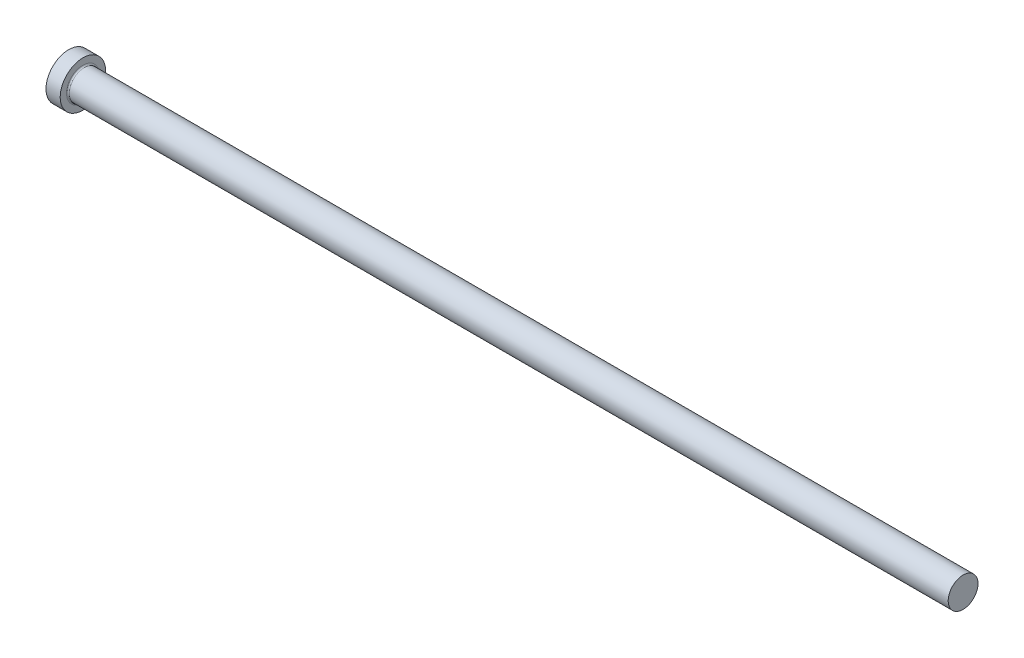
ISO-10303-21;
HEADER;
FILE_DESCRIPTION(('STEP AP214'),'2;1');
FILE_NAME('part.step','',(''),(''),'','','');
FILE_SCHEMA(('AUTOMOTIVE_DESIGN { 1 0 10303 214 1 1 1 1 }'));
ENDSEC;
DATA;
#1=APPLICATION_CONTEXT('core data for automotive mechanical design processes');
#2=APPLICATION_PROTOCOL_DEFINITION('international standard','automotive_design',2000,#1);
#3=PRODUCT_CONTEXT('',#1,'mechanical');
#4=PRODUCT('Part','Part','',(#3));
#5=PRODUCT_RELATED_PRODUCT_CATEGORY('part','',(#4));
#6=PRODUCT_DEFINITION_FORMATION('','',#4);
#7=PRODUCT_DEFINITION_CONTEXT('part definition',#1,'design');
#8=PRODUCT_DEFINITION('design','',#6,#7);
#9=PRODUCT_DEFINITION_SHAPE('','',#8);
#10=(LENGTH_UNIT() NAMED_UNIT(*) SI_UNIT(.MILLI.,.METRE.));
#11=(NAMED_UNIT(*) PLANE_ANGLE_UNIT() SI_UNIT($,.RADIAN.));
#12=(NAMED_UNIT(*) SI_UNIT($,.STERADIAN.) SOLID_ANGLE_UNIT());
#13=UNCERTAINTY_MEASURE_WITH_UNIT(LENGTH_MEASURE(1.E-05),#10,'distance_accuracy_value','');
#14=(GEOMETRIC_REPRESENTATION_CONTEXT(3) GLOBAL_UNCERTAINTY_ASSIGNED_CONTEXT((#13)) GLOBAL_UNIT_ASSIGNED_CONTEXT((#10,
#11,#12)) REPRESENTATION_CONTEXT('',''));
#15=CARTESIAN_POINT('',(0.,0.,0.));
#16=DIRECTION('',(0.,0.,1.));
#17=DIRECTION('',(1.,0.,0.));
#18=AXIS2_PLACEMENT_3D('',#15,#16,#17);
#19=CARTESIAN_POINT('',(0.,0.,0.));
#20=DIRECTION('',(-1.,0.,0.));
#21=DIRECTION('',(0.,-1.,0.));
#22=AXIS2_PLACEMENT_3D('',#19,#20,#21);
#23=PLANE('',#22);
#24=CARTESIAN_POINT('',(0.,0.,0.));
#25=DIRECTION('',(1.,0.,0.));
#26=DIRECTION('',(0.,1.,0.));
#27=AXIS2_PLACEMENT_3D('',#24,#25,#26);
#28=CIRCLE('',#27,8.);
#29=CARTESIAN_POINT('',(0.,8.,0.));
#30=VERTEX_POINT('',#29);
#31=EDGE_CURVE('E25',#30,#30,#28,.T.);
#32=ORIENTED_EDGE('',*,*,#31,.F.);
#33=EDGE_LOOP('',(#32));
#34=FACE_BOUND('',#33,.T.);
#35=ADVANCED_FACE('F14',(#34),#23,.T.);
#36=CARTESIAN_POINT('',(315.,0.,0.));
#37=DIRECTION('',(1.,0.,0.));
#38=DIRECTION('',(0.,1.,0.));
#39=AXIS2_PLACEMENT_3D('',#36,#37,#38);
#40=CYLINDRICAL_SURFACE('',#39,8.);
#41=ORIENTED_EDGE('',*,*,#31,.T.);
#42=EDGE_LOOP('',(#41));
#43=FACE_BOUND('',#42,.T.);
#44=CARTESIAN_POINT('',(5.,0.,0.));
#45=DIRECTION('',(1.,0.,0.));
#46=DIRECTION('',(0.,1.,0.));
#47=AXIS2_PLACEMENT_3D('',#44,#45,#46);
#48=CIRCLE('',#47,8.);
#49=CARTESIAN_POINT('',(5.,8.,0.));
#50=VERTEX_POINT('',#49);
#51=EDGE_CURVE('E29',#50,#50,#48,.T.);
#52=ORIENTED_EDGE('',*,*,#51,.F.);
#53=EDGE_LOOP('',(#52));
#54=FACE_BOUND('',#53,.T.);
#55=ADVANCED_FACE('F51',(#43,#54),#40,.T.);
#56=CARTESIAN_POINT('',(5.,8.,0.));
#57=DIRECTION('',(1.,0.,0.));
#58=DIRECTION('',(0.,1.,0.));
#59=AXIS2_PLACEMENT_3D('',#56,#57,#58);
#60=PLANE('',#59);
#61=CARTESIAN_POINT('',(5.,0.,0.));
#62=DIRECTION('',(1.,0.,0.));
#63=DIRECTION('',(0.,1.,0.));
#64=AXIS2_PLACEMENT_3D('',#61,#62,#63);
#65=CIRCLE('',#64,5.75);
#66=CARTESIAN_POINT('',(5.,5.75,0.));
#67=VERTEX_POINT('',#66);
#68=EDGE_CURVE('E9',#67,#67,#65,.F.);
#69=ORIENTED_EDGE('',*,*,#68,.T.);
#70=EDGE_LOOP('',(#69));
#71=FACE_BOUND('',#70,.T.);
#72=ORIENTED_EDGE('',*,*,#51,.T.);
#73=EDGE_LOOP('',(#72));
#74=FACE_BOUND('',#73,.T.);
#75=ADVANCED_FACE('F42',(#71,#74),#60,.T.);
#76=CARTESIAN_POINT('',(315.,0.,0.));
#77=DIRECTION('',(1.,0.,0.));
#78=DIRECTION('',(0.,1.,0.));
#79=AXIS2_PLACEMENT_3D('',#76,#77,#78);
#80=CYLINDRICAL_SURFACE('',#79,5.24999999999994);
#81=CARTESIAN_POINT('',(5.5,0.,0.));
#82=DIRECTION('',(1.,0.,0.));
#83=DIRECTION('',(0.,1.,0.));
#84=AXIS2_PLACEMENT_3D('',#81,#82,#83);
#85=CIRCLE('',#84,5.24999999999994);
#86=CARTESIAN_POINT('',(5.5,5.24999999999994,0.));
#87=VERTEX_POINT('',#86);
#88=EDGE_CURVE('E21',#87,#87,#85,.T.);
#89=ORIENTED_EDGE('',*,*,#88,.T.);
#90=EDGE_LOOP('',(#89));
#91=FACE_BOUND('',#90,.T.);
#92=CARTESIAN_POINT('',(315.,0.,0.));
#93=DIRECTION('',(1.,0.,0.));
#94=DIRECTION('',(0.,1.,0.));
#95=AXIS2_PLACEMENT_3D('',#92,#93,#94);
#96=CIRCLE('',#95,5.25);
#97=CARTESIAN_POINT('',(315.,5.25000000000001,0.));
#98=VERTEX_POINT('',#97);
#99=EDGE_CURVE('E34',#98,#98,#96,.T.);
#100=ORIENTED_EDGE('',*,*,#99,.F.);
#101=EDGE_LOOP('',(#100));
#102=FACE_BOUND('',#101,.T.);
#103=ADVANCED_FACE('F40',(#91,#102),#80,.T.);
#104=CARTESIAN_POINT('',(315.,5.25,0.));
#105=DIRECTION('',(1.,0.,0.));
#106=DIRECTION('',(0.,1.,0.));
#107=AXIS2_PLACEMENT_3D('',#104,#105,#106);
#108=PLANE('',#107);
#109=ORIENTED_EDGE('',*,*,#99,.T.);
#110=EDGE_LOOP('',(#109));
#111=FACE_BOUND('',#110,.T.);
#112=ADVANCED_FACE('F38',(#111),#108,.T.);
#113=CARTESIAN_POINT('',(5.5,0.,0.));
#114=DIRECTION('',(1.,0.,0.));
#115=DIRECTION('',(0.,1.,0.));
#116=AXIS2_PLACEMENT_3D('',#113,#114,#115);
#117=TOROIDAL_SURFACE('',#116,5.75,0.5);
#118=ORIENTED_EDGE('',*,*,#68,.F.);
#119=EDGE_LOOP('',(#118));
#120=FACE_BOUND('',#119,.T.);
#121=ORIENTED_EDGE('',*,*,#88,.F.);
#122=EDGE_LOOP('',(#121));
#123=FACE_BOUND('',#122,.T.);
#124=ADVANCED_FACE('F16',(#120,#123),#117,.F.);
#125=CLOSED_SHELL('',(#35,#55,#75,#103,#112,#124));
#126=MANIFOLD_SOLID_BREP('B1',#125);
#127=ADVANCED_BREP_SHAPE_REPRESENTATION('',(#18,#126),#14);
#128=SHAPE_DEFINITION_REPRESENTATION(#9,#127);
ENDSEC;
END-ISO-10303-21;
